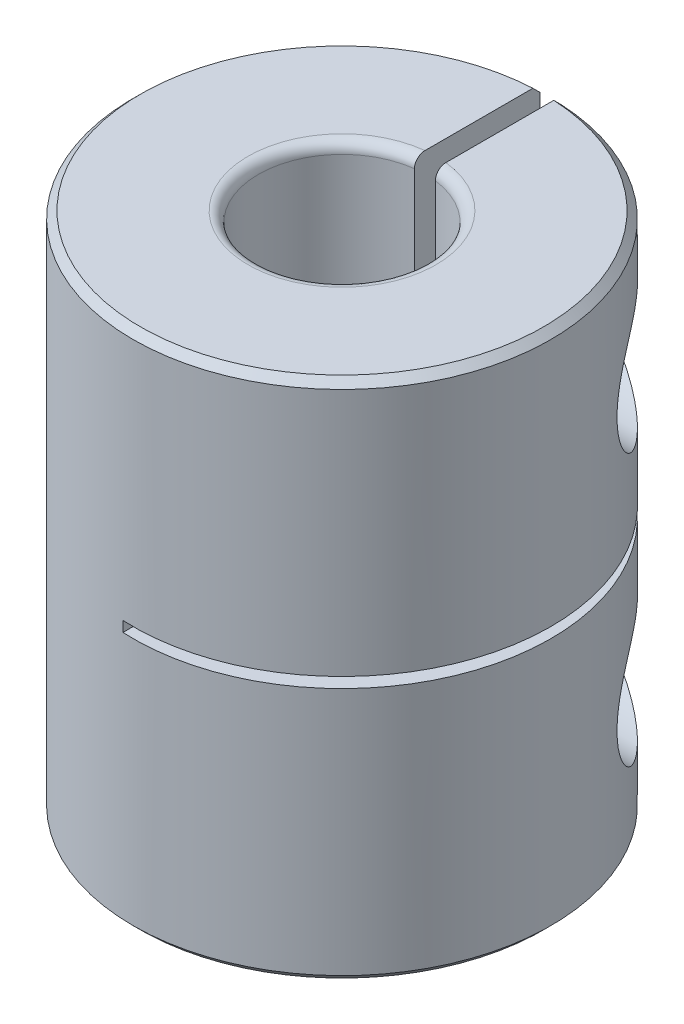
from build123d import *

# Parameters (mm, degrees)
SKETCH1_R           = 10
BOSS_EXTRUDE1_DEPTH = 25
SKETCH2_R           = 4
CUT_EXTRUDE1_DEPTH  = 12.5
SKETCH3_R           = 2.5
CUT_EXTRUDE2_DEPTH  = 12.5
FILLET1_R           = 0.5
CHAMFER2_SIZE       = 0.5
CHAMFER3_SIZE       = 0.35
SKETCH4_R           = 3
CUT_EXTRUDE3_DEPTH  = 8
SKETCH5_R           = 1.25
CUT_EXTRUDE4_DEPTH  = 30.478806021
SKETCH6_W           = 1
SKETCH6_H           = 25
CUT_EXTRUDE5_DEPTH  = 13.95
SKETCH7_W           = 20.006481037
SKETCH7_H           = 0.5
CUT_EXTRUDE6_DEPTH  = 10.5
CUT_EXTRUDE7_START  = 13.975
SKETCH8_R           = 4
CUT_EXTRUDE7_DEPTH  = 13.975


with BuildPart() as part:
    # Sketch1 → Boss-Extrude1 (new body)
    with BuildSketch(Plane(origin=(0, 0, 0), x_dir=(1, 0, 0), z_dir=(0, 1, 0))):
        with Locations(Location((0, 0, 0), (0, 0, 270))):
            Circle(SKETCH1_R)
    extrude(amount=BOSS_EXTRUDE1_DEPTH)

    # Sketch2 → Cut-Extrude1 (cut)
    with BuildSketch(Plane(origin=(0, 25, 0), x_dir=(1, 0, 0), z_dir=(0, 1, 0))):
        with Locations(Location((0, 0, 0), (0, 0, 270))):
            Circle(SKETCH2_R)
    extrude(amount=-CUT_EXTRUDE1_DEPTH, mode=Mode.SUBTRACT)

    # Sketch3 → Cut-Extrude2 (cut)
    with BuildSketch(Plane.XZ):
        with Locations(Location((0, 0, 0), (0, 0, 270))):
            Circle(SKETCH3_R)
    extrude(amount=-CUT_EXTRUDE2_DEPTH, mode=Mode.SUBTRACT)

    # Fillet1
    fillet1_edges = [part.edges().sort_by_distance(p)[0] for p in [
        (0, 0, 2.5),
        (0, 25, -4),
    ]]
    fillet(fillet1_edges, radius=FILLET1_R)

    # Chamfer2
    chamfer2_edges = [part.edges().sort_by_distance(p)[0] for p in [
        (0, 12.5, 2.5),
    ]]
    chamfer(chamfer2_edges, length=CHAMFER2_SIZE)

    # Chamfer3
    chamfer3_edges = [part.edges().sort_by_distance(p)[0] for p in [
        (0, 0, -10),
        (0, 25, -10),
    ]]
    chamfer(chamfer3_edges, length=CHAMFER3_SIZE)

    # Sketch4 → Cut-Extrude3 (cut)
    with BuildSketch(Plane.ZY.offset(-10)):
        with Locations((-7, 19)):
            Circle(SKETCH4_R)
        with Locations((-7, 6)):
            Circle(SKETCH4_R)
    extrude(amount=CUT_EXTRUDE3_DEPTH, mode=Mode.SUBTRACT)

    # Sketch5 → Cut-Extrude4 (cut, through all)
    with BuildSketch(Plane(origin=(2, 0, 0), x_dir=(0, 0, -1), z_dir=(1, 0, 0))):
        with Locations((7, 19)):
            Circle(SKETCH5_R)
        with Locations((7, 6)):
            Circle(SKETCH5_R)
    extrude(amount=-CUT_EXTRUDE4_DEPTH, mode=Mode.SUBTRACT)

    # Sketch6 → Cut-Extrude5 (cut)
    with BuildSketch(Plane.XY.offset(-10)):
        with Locations((0, 12.5)):
            Rectangle(SKETCH6_W, SKETCH6_H)
    extrude(amount=CUT_EXTRUDE5_DEPTH, mode=Mode.SUBTRACT)

    # Sketch7 → Cut-Extrude6 (cut)
    with BuildSketch(Plane.ZY.offset(-10)):
        with Locations((0.003240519, 12.5)):
            Rectangle(SKETCH7_W, SKETCH7_H)
    extrude(amount=CUT_EXTRUDE6_DEPTH, mode=Mode.SUBTRACT)

    # Sketch8 → Cut-Extrude7 (cut)
    with BuildSketch(Plane(origin=(0, 12.25, 0), x_dir=(1, 0, 0), z_dir=(0, 1, 0)).offset(CUT_EXTRUDE7_START)):
        Circle(SKETCH8_R)
    extrude(amount=-CUT_EXTRUDE7_DEPTH, mode=Mode.SUBTRACT)


solid = part.part
